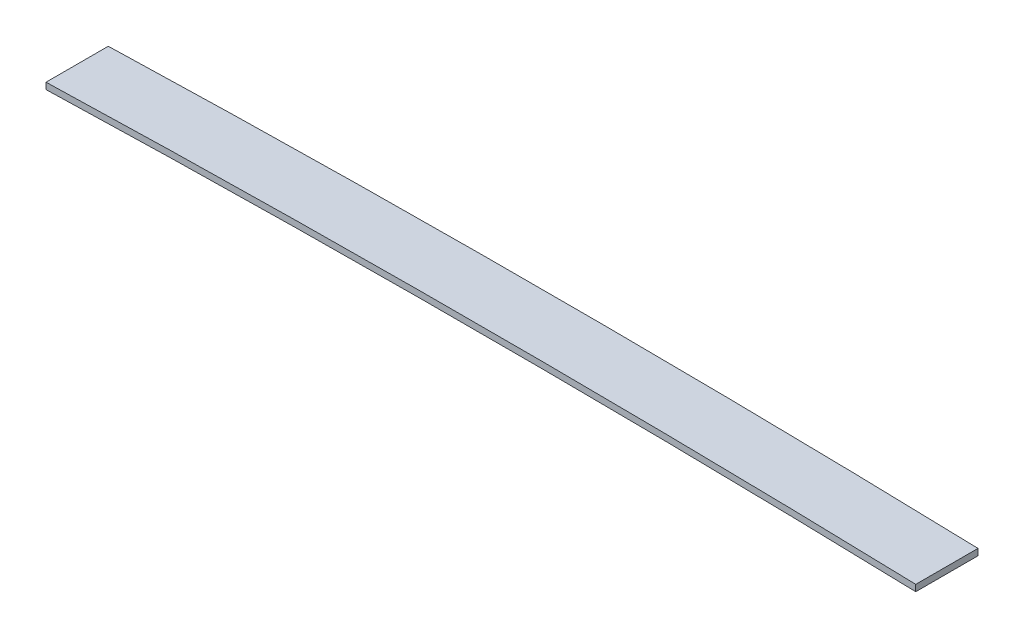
from build123d import *

# Parameters (mm, degrees)
EXTRUDE_348_DEPTH = 31.5


with BuildPart() as part:
    # Sketch 1 → Extrude 348 (new, symmetric)
    with BuildSketch(Plane.XY):
        with BuildLine():
            Line((-440, 6.5), (-440, 0))
            ThreePointArc((-440, 0), (0, 6.5), (440, 0))
            Line((440, 0), (440, 6.5))
            ThreePointArc((440, 6.5), (0, 13), (-440, 6.5))
        make_face()
    extrude(amount=EXTRUDE_348_DEPTH, both=True)


solid = part.part
